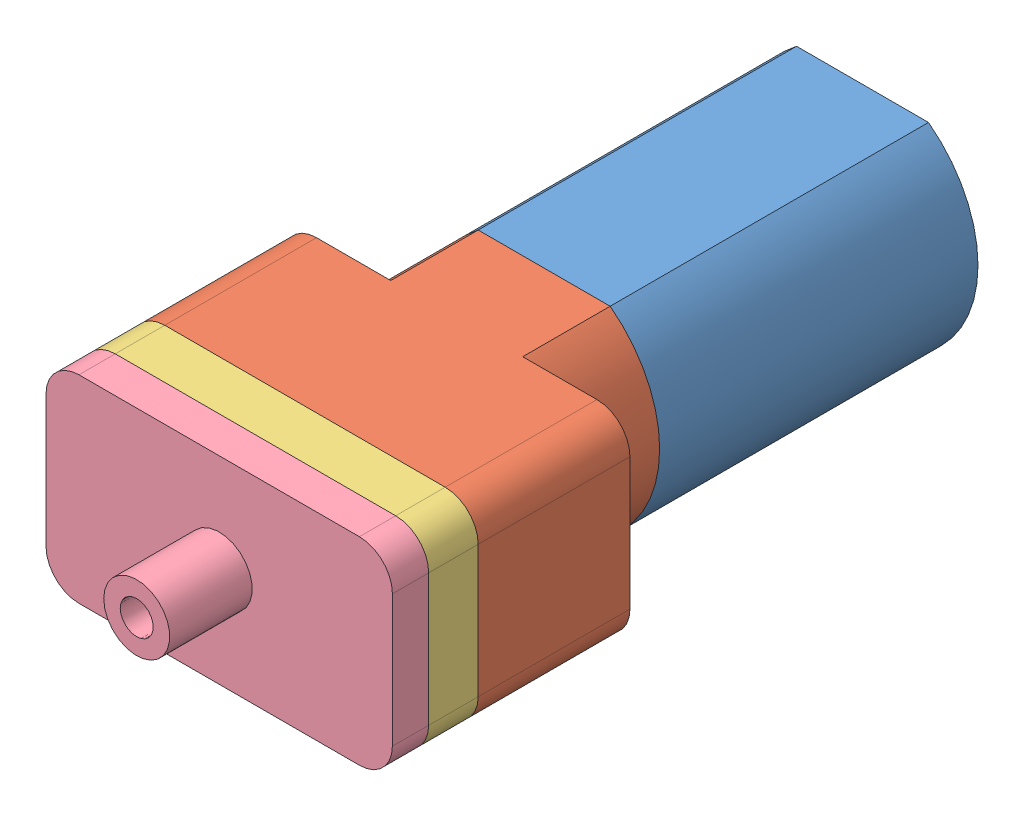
SolidWorks assembly compresseur.SLDASM, configuration Défaut (file format 4400). Lengths in mm.
Overall size (21 12 44).
12 component instances, 11 part files, 22 mates.
Components (placement in the parent):
- moteur-1: moteur.SLDPRT [Défaut] at origin size (14 12 19.3)
- carter1-1: carter1.SLDPRT [Défaut] at (0 0 19.3) size (21 12 14.5)
- carter3-1: carter3.SLDPRT [Défaut] at (0 0 36.8) size (21 12 3)
- carter2-1: carter2.SLDPRT [Défaut] at (0 0 36.8) size (21 12 7.2)
- axe large-2: axe large.SLDPRT [Défaut] at (0 0 17.3) size (1.5 1.5 5)
- excentrique-1: excentrique.sldprt [Défaut] at (0 0 26.9) x (0 0 1) z (0 -1 0) size (5.6 8.4 8.4)
- axe fin-1: axe fin.SLDPRT [Défaut] at (2.8013 0 21.657) x (0.432212 0.895782 0.103765) z (-0.233445 0 0.97237) size (1 1 10)
- plateau-1: plateau.sldprt [Défaut] at (0 0 33.3255) x (0 1 0) z (0.233445 0 -0.97237) size (4 13.61 4)
- piston-1: piston.SLDPRT [Défaut] at (4.5 0 33.421) size (1.5 1.5 4.75) (hidden)
- membrane-1: membrane.SLDPRT [Défaut] at (4.8679 0 32.0406) x (0 0 1) z (-1 0 0) size (4.48 4.93 5.22)
- piston-2: piston.SLDPRT [Défaut] at (-4.5 0 31.1281) x (-0.936013 -0.351964 0) z (0 0 1) size (1.5 1.5 4.75) (hidden)
- membrane2-1: membrane2.SLDPRT [Défaut] at (-3.8834 0 29.9395) x (0 0 1) z (-0.999608 -0.028012 0) size (6.58 4.87 5.45)
Mates (geometry in assembly coordinates):
- Coïncidente1: coincident anti-aligned: plane of moteur-1 through (-0.5 0 19.3) normal (0 0 1); plane of carter1-1 through (-0.5 0 19.3) normal (0 0 -1)
- Coïncidente2: coincident aligned: circle of moteur-1; circle of carter1-1
- Coïncidente3: coincident anti-aligned: plane of carter1-1 through (-8.5 4 33.8) normal (0 0 1); plane of carter3-1 through (-8.5 -4 33.8) normal (0 0 -1)
- Coïncidente4: coincident aligned: circle of carter1-1; circle of carter3-1
- Coïncidente5: coincident anti-aligned: plane of carter3-1 through (-8.5 -4 36.8) normal (0 0 1); plane of carter2-1 through (-8.5 -4 36.8) normal (0 0 -1)
- Coïncidente6: coincident aligned: circle of carter3-1; circle of carter2-1
- Coaxiale1: concentric: cylinder of moteur-1 through (0 0 17.3) axis (0 0 1) radius 0.75; cylinder of axe large-2 through (0 0 22.3) axis (0 0 -1) radius 0.75
- Coïncidente7: coincident: plane of moteur-1 through (0 0 17.3) normal (0 0 1); plane of axe large-2 through (0 0 17.3) normal (0 0 -1)
- Distance1: distance = 2 mm: plane of excentrique-1 through (4.2 0 21.3) normal (0 0 -1); plane of moteur-1 through (-0.5 0 19.3) normal (0 0 1)
- Coaxiale3: concentric: cylinder of axe large-2 through (0 0 22.3) axis (0 0 -1) radius 0.75; cylinder of excentrique-1 through (0 0 25.4) axis (0 0 -1) radius 0.75
- Coaxiale5: concentric: cylinder of excentrique-1 through (2.6491 0 22.2911) axis (-0.233445 0 0.97237) radius 0.5; cylinder of axe fin-1 through (0.4669 0 31.3807) axis (0.233445 0 -0.97237) radius 0.5
- Coaxiale6: concentric: cylinder of axe fin-1 through (0.4669 0 31.3807) axis (0.233445 0 -0.97237) radius 0.5; cylinder of plateau-1 through (0 0 33.3255) axis (-0.233445 0 0.97237) radius 0.5
- Coïncidente9: coincident: plane of axe fin-1 through (0.4669 0 31.3807) normal (-0.233445 0 0.97237); plane of plateau-1 through (0.4669 0 31.3807) normal (0.233445 0 -0.97237)
- Coïncidente12: coincident: line of axe large-2 through (0 0 22.3) axis (0 0 -1); moEndPointRef_w of plateau-1
- Coaxiale7: concentric: cylinder of carter3-1 through (4.5 0 36.8) axis (0 0 -1) radius 0.5; cylinder of piston-1 through (4.5 0 37.421) axis (0 0 -1) radius 0.5
- Coïncidente13: coincident: line of plateau-1 through (7 0 33.3255) axis (-1 0 0); point of piston-1
- Parallèle1: parallel: cylinder of excentrique-1 through (0 0 25.4) axis (0 0 -1) radius 4.2; cylinder of membrane-1 through (4.8679 0 31.4595) axis (0 0 -1) radius 0.5
- Coïncidente18: coincident: point of plateau-1; point of membrane-1
- Coaxiale8: concentric: cylinder of carter3-1 through (-4.5 0 36.8) axis (0 0 -1) radius 0.5; cylinder of piston-2 through (-4.5 0 35.1281) axis (0 0 -1) radius 0.5
- Coïncidente21: coincident: plane of plateau-1 through (-6.237 -2 30.1476) normal (-0.45399 0 0.891007); point of piston-2
- Parallèle6: parallel: cylinder of excentrique-1 through (0 0 25.4) axis (0 0 -1) radius 4.2; cylinder of membrane2-1 through (-3.8834 0 29.3585) axis (0 0 -1) radius 0.5
- Coïncidente26: coincident: unknown of plateau-1; unknown of membrane2-1; unknown of ?; unknown of ?; unknown of ?; unknown of ?
